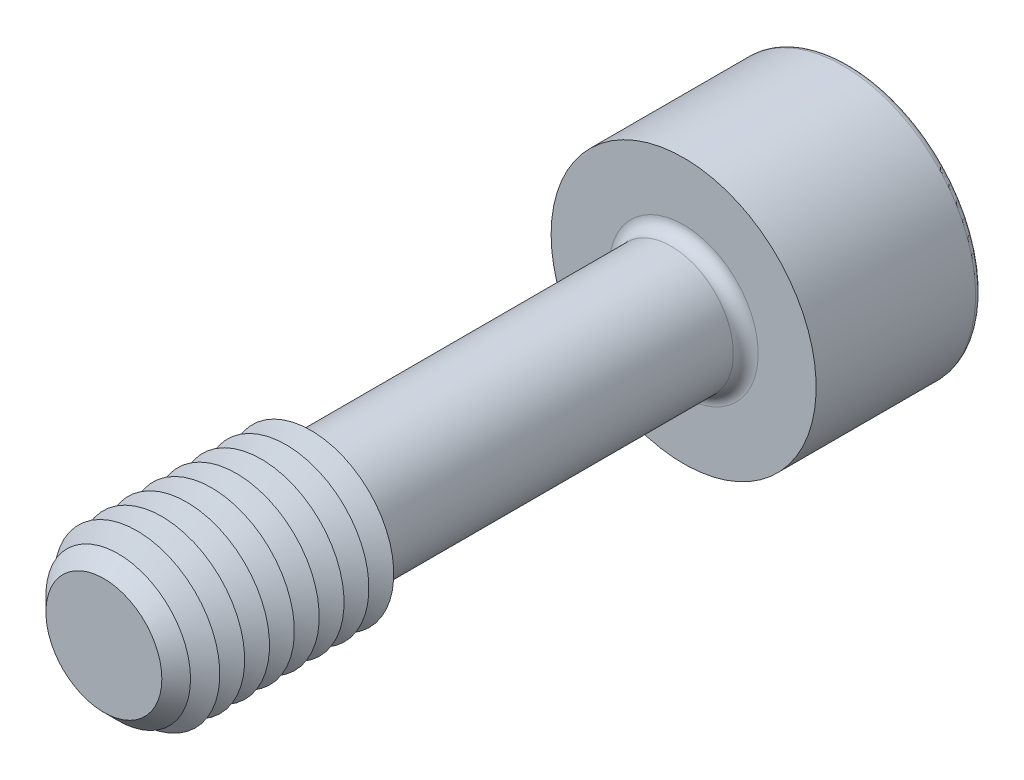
ISO-10303-21;
HEADER;
FILE_DESCRIPTION(('STEP AP214'),'2;1');
FILE_NAME('part.step','',(''),(''),'','','');
FILE_SCHEMA(('AUTOMOTIVE_DESIGN { 1 0 10303 214 1 1 1 1 }'));
ENDSEC;
DATA;
#1=APPLICATION_CONTEXT('core data for automotive mechanical design processes');
#2=APPLICATION_PROTOCOL_DEFINITION('international standard','automotive_design',2000,#1);
#3=PRODUCT_CONTEXT('',#1,'mechanical');
#4=PRODUCT('Part','Part','',(#3));
#5=PRODUCT_RELATED_PRODUCT_CATEGORY('part','',(#4));
#6=PRODUCT_DEFINITION_FORMATION('','',#4);
#7=PRODUCT_DEFINITION_CONTEXT('part definition',#1,'design');
#8=PRODUCT_DEFINITION('design','',#6,#7);
#9=PRODUCT_DEFINITION_SHAPE('','',#8);
#10=(LENGTH_UNIT() NAMED_UNIT(*) SI_UNIT(.MILLI.,.METRE.));
#11=(NAMED_UNIT(*) PLANE_ANGLE_UNIT() SI_UNIT($,.RADIAN.));
#12=(NAMED_UNIT(*) SI_UNIT($,.STERADIAN.) SOLID_ANGLE_UNIT());
#13=UNCERTAINTY_MEASURE_WITH_UNIT(LENGTH_MEASURE(1.E-05),#10,'distance_accuracy_value','');
#14=(GEOMETRIC_REPRESENTATION_CONTEXT(3) GLOBAL_UNCERTAINTY_ASSIGNED_CONTEXT((#13)) GLOBAL_UNIT_ASSIGNED_CONTEXT((#10,
#11,#12)) REPRESENTATION_CONTEXT('',''));
#15=CARTESIAN_POINT('',(0.,0.,0.));
#16=DIRECTION('',(0.,0.,1.));
#17=DIRECTION('',(1.,0.,0.));
#18=AXIS2_PLACEMENT_3D('',#15,#16,#17);
#19=CARTESIAN_POINT('',(-2.3094010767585,-4.,-19.5));
#20=DIRECTION('',(0.,0.,1.));
#21=DIRECTION('',(1.,0.,0.));
#22=AXIS2_PLACEMENT_3D('',#19,#20,#21);
#23=PLANE('',#22);
#24=DIRECTION('',(1.,0.,0.));
#25=VECTOR('',#24,1.);
#26=CARTESIAN_POINT('',(-2.3094010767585,-4.,-19.5));
#27=LINE('',#26,#25);
#28=CARTESIAN_POINT('',(0.,-4.,-19.5));
#29=VERTEX_POINT('',#28);
#30=CARTESIAN_POINT('',(2.3094010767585,-4.,-19.5));
#31=VERTEX_POINT('',#30);
#32=EDGE_CURVE('E761',#29,#31,#27,.T.);
#33=ORIENTED_EDGE('',*,*,#32,.F.);
#34=CARTESIAN_POINT('',(0.,0.,-19.5));
#35=DIRECTION('',(0.,0.,1.));
#36=DIRECTION('',(0.,-1.,0.));
#37=AXIS2_PLACEMENT_3D('',#34,#35,#36);
#38=CIRCLE('',#37,4.);
#39=CARTESIAN_POINT('',(3.46410161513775,-2.,-19.5));
#40=VERTEX_POINT('',#39);
#41=EDGE_CURVE('E53',#29,#40,#38,.T.);
#42=ORIENTED_EDGE('',*,*,#41,.T.);
#43=DIRECTION('',(0.5,0.866025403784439,0.));
#44=VECTOR('',#43,1.);
#45=CARTESIAN_POINT('',(2.3094010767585,-4.,-19.5));
#46=LINE('',#45,#44);
#47=EDGE_CURVE('E747',#31,#40,#46,.T.);
#48=ORIENTED_EDGE('',*,*,#47,.F.);
#49=EDGE_LOOP('',(#33,#42,#48));
#50=FACE_BOUND('',#49,.T.);
#51=ADVANCED_FACE('F41',(#50),#23,.F.);
#52=CARTESIAN_POINT('',(4.618802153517,0.,-19.5));
#53=VERTEX_POINT('',#52);
#54=EDGE_CURVE('E758',#40,#53,#46,.T.);
#55=ORIENTED_EDGE('',*,*,#54,.F.);
#56=CARTESIAN_POINT('',(3.46410161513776,2.,-19.5));
#57=VERTEX_POINT('',#56);
#58=EDGE_CURVE('E11',#40,#57,#38,.T.);
#59=ORIENTED_EDGE('',*,*,#58,.T.);
#60=DIRECTION('',(-0.5,0.866025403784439,0.));
#61=VECTOR('',#60,1.);
#62=CARTESIAN_POINT('',(4.618802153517,0.,-19.5));
#63=LINE('',#62,#61);
#64=EDGE_CURVE('E746',#53,#57,#63,.T.);
#65=ORIENTED_EDGE('',*,*,#64,.F.);
#66=EDGE_LOOP('',(#55,#59,#65));
#67=FACE_BOUND('',#66,.T.);
#68=ADVANCED_FACE('F133',(#67),#23,.F.);
#69=CARTESIAN_POINT('',(2.3094010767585,4.,-19.5));
#70=VERTEX_POINT('',#69);
#71=EDGE_CURVE('E742',#57,#70,#63,.T.);
#72=ORIENTED_EDGE('',*,*,#71,.F.);
#73=CARTESIAN_POINT('',(0.,4.,-19.5));
#74=VERTEX_POINT('',#73);
#75=EDGE_CURVE('E51',#57,#74,#38,.T.);
#76=ORIENTED_EDGE('',*,*,#75,.T.);
#77=DIRECTION('',(-1.,0.,0.));
#78=VECTOR('',#77,1.);
#79=CARTESIAN_POINT('',(2.3094010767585,4.,-19.5));
#80=LINE('',#79,#78);
#81=EDGE_CURVE('E177',#70,#74,#80,.T.);
#82=ORIENTED_EDGE('',*,*,#81,.F.);
#83=EDGE_LOOP('',(#72,#76,#82));
#84=FACE_BOUND('',#83,.T.);
#85=ADVANCED_FACE('F139',(#84),#23,.F.);
#86=CARTESIAN_POINT('',(-2.3094010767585,4.,-19.5));
#87=VERTEX_POINT('',#86);
#88=EDGE_CURVE('E752',#74,#87,#80,.T.);
#89=ORIENTED_EDGE('',*,*,#88,.F.);
#90=CARTESIAN_POINT('',(-3.46410161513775,2.,-19.5));
#91=VERTEX_POINT('',#90);
#92=EDGE_CURVE('E263',#74,#91,#38,.T.);
#93=ORIENTED_EDGE('',*,*,#92,.T.);
#94=DIRECTION('',(-0.500000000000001,-0.866025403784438,0.));
#95=VECTOR('',#94,1.);
#96=CARTESIAN_POINT('',(-2.3094010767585,4.,-19.5));
#97=LINE('',#96,#95);
#98=EDGE_CURVE('E176',#87,#91,#97,.T.);
#99=ORIENTED_EDGE('',*,*,#98,.F.);
#100=EDGE_LOOP('',(#89,#93,#99));
#101=FACE_BOUND('',#100,.T.);
#102=ADVANCED_FACE('F157',(#101),#23,.F.);
#103=CARTESIAN_POINT('',(-4.61880215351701,0.,-19.5));
#104=VERTEX_POINT('',#103);
#105=EDGE_CURVE('E170',#91,#104,#97,.T.);
#106=ORIENTED_EDGE('',*,*,#105,.F.);
#107=CARTESIAN_POINT('',(-3.46410161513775,-2.,-19.5));
#108=VERTEX_POINT('',#107);
#109=EDGE_CURVE('E172',#91,#108,#38,.T.);
#110=ORIENTED_EDGE('',*,*,#109,.T.);
#111=DIRECTION('',(0.5,-0.866025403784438,0.));
#112=VECTOR('',#111,1.);
#113=CARTESIAN_POINT('',(-4.61880215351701,0.,-19.5));
#114=LINE('',#113,#112);
#115=EDGE_CURVE('E174',#104,#108,#114,.T.);
#116=ORIENTED_EDGE('',*,*,#115,.F.);
#117=EDGE_LOOP('',(#106,#110,#116));
#118=FACE_BOUND('',#117,.T.);
#119=ADVANCED_FACE('F146',(#118),#23,.F.);
#120=CARTESIAN_POINT('',(0.,0.,-27.5));
#121=DIRECTION('',(0.,0.,-1.));
#122=DIRECTION('',(-1.,0.,0.));
#123=AXIS2_PLACEMENT_3D('',#120,#121,#122);
#124=PLANE('',#123);
#125=CARTESIAN_POINT('',(0.,0.,-27.5));
#126=DIRECTION('',(0.,0.,-1.));
#127=DIRECTION('',(-1.,0.,0.));
#128=AXIS2_PLACEMENT_3D('',#125,#126,#127);
#129=CIRCLE('',#128,7.625);
#130=CARTESIAN_POINT('',(-7.625,0.,-27.5));
#131=VERTEX_POINT('',#130);
#132=EDGE_CURVE('E250',#131,#131,#129,.T.);
#133=ORIENTED_EDGE('',*,*,#132,.T.);
#134=EDGE_LOOP('',(#133));
#135=FACE_BOUND('',#134,.T.);
#136=DIRECTION('',(-0.500000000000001,-0.866025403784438,0.));
#137=VECTOR('',#136,1.);
#138=CARTESIAN_POINT('',(-2.3094010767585,4.,-27.5));
#139=LINE('',#138,#137);
#140=CARTESIAN_POINT('',(-2.3094010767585,4.,-27.5));
#141=VERTEX_POINT('',#140);
#142=CARTESIAN_POINT('',(-4.61880215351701,0.,-27.5));
#143=VERTEX_POINT('',#142);
#144=EDGE_CURVE('E211',#141,#143,#139,.T.);
#145=ORIENTED_EDGE('',*,*,#144,.T.);
#146=DIRECTION('',(0.5,-0.866025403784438,0.));
#147=VECTOR('',#146,1.);
#148=CARTESIAN_POINT('',(-4.61880215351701,0.,-27.5));
#149=LINE('',#148,#147);
#150=CARTESIAN_POINT('',(-2.3094010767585,-4.,-27.5));
#151=VERTEX_POINT('',#150);
#152=EDGE_CURVE('E67',#143,#151,#149,.T.);
#153=ORIENTED_EDGE('',*,*,#152,.T.);
#154=DIRECTION('',(1.,0.,0.));
#155=VECTOR('',#154,1.);
#156=CARTESIAN_POINT('',(-2.3094010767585,-4.,-27.5));
#157=LINE('',#156,#155);
#158=CARTESIAN_POINT('',(2.3094010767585,-4.,-27.5));
#159=VERTEX_POINT('',#158);
#160=EDGE_CURVE('E195',#151,#159,#157,.T.);
#161=ORIENTED_EDGE('',*,*,#160,.T.);
#162=DIRECTION('',(0.5,0.866025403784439,0.));
#163=VECTOR('',#162,1.);
#164=CARTESIAN_POINT('',(2.3094010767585,-4.,-27.5));
#165=LINE('',#164,#163);
#166=CARTESIAN_POINT('',(4.618802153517,0.,-27.5));
#167=VERTEX_POINT('',#166);
#168=EDGE_CURVE('E199',#159,#167,#165,.T.);
#169=ORIENTED_EDGE('',*,*,#168,.T.);
#170=DIRECTION('',(-0.5,0.866025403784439,0.));
#171=VECTOR('',#170,1.);
#172=CARTESIAN_POINT('',(4.618802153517,0.,-27.5));
#173=LINE('',#172,#171);
#174=CARTESIAN_POINT('',(2.3094010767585,4.,-27.5));
#175=VERTEX_POINT('',#174);
#176=EDGE_CURVE('E203',#167,#175,#173,.T.);
#177=ORIENTED_EDGE('',*,*,#176,.T.);
#178=DIRECTION('',(-1.,0.,0.));
#179=VECTOR('',#178,1.);
#180=CARTESIAN_POINT('',(2.3094010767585,4.,-27.5));
#181=LINE('',#180,#179);
#182=EDGE_CURVE('E207',#175,#141,#181,.T.);
#183=ORIENTED_EDGE('',*,*,#182,.T.);
#184=EDGE_LOOP('',(#145,#153,#161,#169,#177,#183));
#185=FACE_BOUND('',#184,.T.);
#186=ADVANCED_FACE('F156',(#135,#185),#124,.T.);
#187=CARTESIAN_POINT('',(0.,0.,17.5));
#188=DIRECTION('',(0.,0.,-1.));
#189=DIRECTION('',(-1.,0.,0.));
#190=AXIS2_PLACEMENT_3D('',#187,#188,#189);
#191=CYLINDRICAL_SURFACE('',#190,3.75);
#192=CARTESIAN_POINT('',(0.,0.,-16.75));
#193=DIRECTION('',(0.,0.,-1.));
#194=DIRECTION('',(-1.,0.,0.));
#195=AXIS2_PLACEMENT_3D('',#192,#193,#194);
#196=CIRCLE('',#195,3.75);
#197=CARTESIAN_POINT('',(-3.75,0.,-16.75));
#198=VERTEX_POINT('',#197);
#199=EDGE_CURVE('E246',#198,#198,#196,.F.);
#200=ORIENTED_EDGE('',*,*,#199,.T.);
#201=EDGE_LOOP('',(#200));
#202=FACE_BOUND('',#201,.T.);
#203=CARTESIAN_POINT('',(0.,0.,4.27831216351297));
#204=DIRECTION('',(0.,0.,-1.));
#205=DIRECTION('',(0.,1.,0.));
#206=AXIS2_PLACEMENT_3D('',#203,#204,#205);
#207=CIRCLE('',#206,3.75);
#208=CARTESIAN_POINT('',(0.,3.75,4.27831216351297));
#209=VERTEX_POINT('',#208);
#210=EDGE_CURVE('E234',#209,#209,#207,.T.);
#211=ORIENTED_EDGE('',*,*,#210,.T.);
#212=EDGE_LOOP('',(#211));
#213=FACE_BOUND('',#212,.T.);
#214=ADVANCED_FACE('F163',(#202,#213),#191,.T.);
#215=CARTESIAN_POINT('',(0.,0.,4.27831216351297));
#216=DIRECTION('',(0.,0.,1.));
#217=DIRECTION('',(0.,-1.,0.));
#218=AXIS2_PLACEMENT_3D('',#215,#216,#217);
#219=CONICAL_SURFACE('',#218,3.75,1.0471975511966);
#220=CARTESIAN_POINT('',(0.,0.,5.));
#221=DIRECTION('',(0.,0.,-1.));
#222=DIRECTION('',(-1.,0.,0.));
#223=AXIS2_PLACEMENT_3D('',#220,#221,#222);
#224=CIRCLE('',#223,5.);
#225=CARTESIAN_POINT('',(-5.,0.,5.));
#226=VERTEX_POINT('',#225);
#227=EDGE_CURVE('E267',#226,#226,#224,.T.);
#228=ORIENTED_EDGE('',*,*,#227,.T.);
#229=EDGE_LOOP('',(#228));
#230=FACE_BOUND('',#229,.T.);
#231=ORIENTED_EDGE('',*,*,#210,.F.);
#232=EDGE_LOOP('',(#231));
#233=FACE_BOUND('',#232,.T.);
#234=ADVANCED_FACE('F511',(#230,#233),#219,.T.);
#235=CARTESIAN_POINT('',(0.,0.,-17.5));
#236=DIRECTION('',(0.,0.,-1.));
#237=DIRECTION('',(-1.,0.,0.));
#238=AXIS2_PLACEMENT_3D('',#235,#236,#237);
#239=PLANE('',#238);
#240=CARTESIAN_POINT('',(0.,0.,-17.5));
#241=DIRECTION('',(0.,0.,-1.));
#242=DIRECTION('',(-1.,0.,0.));
#243=AXIS2_PLACEMENT_3D('',#240,#241,#242);
#244=CIRCLE('',#243,4.5);
#245=CARTESIAN_POINT('',(-4.5,0.,-17.5));
#246=VERTEX_POINT('',#245);
#247=EDGE_CURVE('E242',#246,#246,#244,.T.);
#248=ORIENTED_EDGE('',*,*,#247,.T.);
#249=EDGE_LOOP('',(#248));
#250=FACE_BOUND('',#249,.T.);
#251=CARTESIAN_POINT('',(0.,0.,-17.5));
#252=DIRECTION('',(0.,0.,-1.));
#253=DIRECTION('',(-1.,0.,0.));
#254=AXIS2_PLACEMENT_3D('',#251,#252,#253);
#255=CIRCLE('',#254,8.);
#256=CARTESIAN_POINT('',(-8.,0.,-17.5));
#257=VERTEX_POINT('',#256);
#258=EDGE_CURVE('E230',#257,#257,#255,.T.);
#259=ORIENTED_EDGE('',*,*,#258,.F.);
#260=EDGE_LOOP('',(#259));
#261=FACE_BOUND('',#260,.T.);
#262=ADVANCED_FACE('F504',(#250,#261),#239,.F.);
#263=CARTESIAN_POINT('',(0.,0.,-27.5));
#264=DIRECTION('',(0.,0.,1.));
#265=DIRECTION('',(1.,0.,0.));
#266=AXIS2_PLACEMENT_3D('',#263,#264,#265);
#267=CYLINDRICAL_SURFACE('',#266,8.);
#268=CARTESIAN_POINT('',(0.,0.,-27.125));
#269=DIRECTION('',(0.,0.,-1.));
#270=DIRECTION('',(-1.,0.,0.));
#271=AXIS2_PLACEMENT_3D('',#268,#269,#270);
#272=CIRCLE('',#271,8.);
#273=CARTESIAN_POINT('',(-8.,0.,-27.125));
#274=VERTEX_POINT('',#273);
#275=EDGE_CURVE('E253',#274,#274,#272,.F.);
#276=ORIENTED_EDGE('',*,*,#275,.T.);
#277=EDGE_LOOP('',(#276));
#278=FACE_BOUND('',#277,.T.);
#279=ORIENTED_EDGE('',*,*,#258,.T.);
#280=EDGE_LOOP('',(#279));
#281=FACE_BOUND('',#280,.T.);
#282=ADVANCED_FACE('F510',(#278,#281),#267,.T.);
#283=CARTESIAN_POINT('',(-4.61880215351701,0.,-19.5));
#284=DIRECTION('',(0.866025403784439,0.5,0.));
#285=DIRECTION('',(-0.5,0.866025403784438,0.));
#286=AXIS2_PLACEMENT_3D('',#283,#284,#285);
#287=PLANE('',#286);
#288=ORIENTED_EDGE('',*,*,#152,.F.);
#289=DIRECTION('',(0.,0.,-1.));
#290=VECTOR('',#289,1.);
#291=CARTESIAN_POINT('',(-4.61880215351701,0.,-19.5));
#292=LINE('',#291,#290);
#293=EDGE_CURVE('E186',#104,#143,#292,.T.);
#294=ORIENTED_EDGE('',*,*,#293,.F.);
#295=ORIENTED_EDGE('',*,*,#115,.T.);
#296=CARTESIAN_POINT('',(-2.3094010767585,-4.,-19.5));
#297=VERTEX_POINT('',#296);
#298=EDGE_CURVE('E214',#108,#297,#114,.T.);
#299=ORIENTED_EDGE('',*,*,#298,.T.);
#300=DIRECTION('',(0.,0.,-1.));
#301=VECTOR('',#300,1.);
#302=CARTESIAN_POINT('',(-2.3094010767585,-4.,-19.5));
#303=LINE('',#302,#301);
#304=EDGE_CURVE('E227',#297,#151,#303,.T.);
#305=ORIENTED_EDGE('',*,*,#304,.T.);
#306=EDGE_LOOP('',(#288,#294,#295,#299,#305));
#307=FACE_BOUND('',#306,.T.);
#308=ADVANCED_FACE('F522',(#307),#287,.T.);
#309=CARTESIAN_POINT('',(-2.3094010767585,-4.,-19.5));
#310=DIRECTION('',(0.,1.,0.));
#311=DIRECTION('',(-1.,0.,0.));
#312=AXIS2_PLACEMENT_3D('',#309,#310,#311);
#313=PLANE('',#312);
#314=ORIENTED_EDGE('',*,*,#160,.F.);
#315=ORIENTED_EDGE('',*,*,#304,.F.);
#316=EDGE_CURVE('E759',#297,#29,#27,.T.);
#317=ORIENTED_EDGE('',*,*,#316,.T.);
#318=ORIENTED_EDGE('',*,*,#32,.T.);
#319=DIRECTION('',(0.,0.,-1.));
#320=VECTOR('',#319,1.);
#321=CARTESIAN_POINT('',(2.3094010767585,-4.,-19.5));
#322=LINE('',#321,#320);
#323=EDGE_CURVE('E224',#31,#159,#322,.T.);
#324=ORIENTED_EDGE('',*,*,#323,.T.);
#325=EDGE_LOOP('',(#314,#315,#317,#318,#324));
#326=FACE_BOUND('',#325,.T.);
#327=ADVANCED_FACE('F538',(#326),#313,.T.);
#328=CARTESIAN_POINT('',(2.3094010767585,-4.,-19.5));
#329=DIRECTION('',(-0.866025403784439,0.5,0.));
#330=DIRECTION('',(-0.5,-0.866025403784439,0.));
#331=AXIS2_PLACEMENT_3D('',#328,#329,#330);
#332=PLANE('',#331);
#333=ORIENTED_EDGE('',*,*,#168,.F.);
#334=ORIENTED_EDGE('',*,*,#323,.F.);
#335=ORIENTED_EDGE('',*,*,#47,.T.);
#336=ORIENTED_EDGE('',*,*,#54,.T.);
#337=DIRECTION('',(0.,0.,-1.));
#338=VECTOR('',#337,1.);
#339=CARTESIAN_POINT('',(4.618802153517,0.,-19.5));
#340=LINE('',#339,#338);
#341=EDGE_CURVE('E221',#53,#167,#340,.T.);
#342=ORIENTED_EDGE('',*,*,#341,.T.);
#343=EDGE_LOOP('',(#333,#334,#335,#336,#342));
#344=FACE_BOUND('',#343,.T.);
#345=ADVANCED_FACE('F548',(#344),#332,.T.);
#346=CARTESIAN_POINT('',(4.618802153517,0.,-19.5));
#347=DIRECTION('',(-0.866025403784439,-0.5,0.));
#348=DIRECTION('',(0.5,-0.866025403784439,0.));
#349=AXIS2_PLACEMENT_3D('',#346,#347,#348);
#350=PLANE('',#349);
#351=ORIENTED_EDGE('',*,*,#176,.F.);
#352=ORIENTED_EDGE('',*,*,#341,.F.);
#353=ORIENTED_EDGE('',*,*,#64,.T.);
#354=ORIENTED_EDGE('',*,*,#71,.T.);
#355=DIRECTION('',(0.,0.,-1.));
#356=VECTOR('',#355,1.);
#357=CARTESIAN_POINT('',(2.3094010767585,4.,-19.5));
#358=LINE('',#357,#356);
#359=EDGE_CURVE('E218',#70,#175,#358,.T.);
#360=ORIENTED_EDGE('',*,*,#359,.T.);
#361=EDGE_LOOP('',(#351,#352,#353,#354,#360));
#362=FACE_BOUND('',#361,.T.);
#363=ADVANCED_FACE('F558',(#362),#350,.T.);
#364=CARTESIAN_POINT('',(2.3094010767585,4.,-19.5));
#365=DIRECTION('',(0.,-1.,0.));
#366=DIRECTION('',(0.,0.,-1.));
#367=AXIS2_PLACEMENT_3D('',#364,#365,#366);
#368=PLANE('',#367);
#369=ORIENTED_EDGE('',*,*,#182,.F.);
#370=ORIENTED_EDGE('',*,*,#359,.F.);
#371=ORIENTED_EDGE('',*,*,#81,.T.);
#372=ORIENTED_EDGE('',*,*,#88,.T.);
#373=DIRECTION('',(0.,0.,-1.));
#374=VECTOR('',#373,1.);
#375=CARTESIAN_POINT('',(-2.3094010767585,4.,-19.5));
#376=LINE('',#375,#374);
#377=EDGE_CURVE('E182',#87,#141,#376,.T.);
#378=ORIENTED_EDGE('',*,*,#377,.T.);
#379=EDGE_LOOP('',(#369,#370,#371,#372,#378));
#380=FACE_BOUND('',#379,.T.);
#381=ADVANCED_FACE('F152',(#380),#368,.T.);
#382=CARTESIAN_POINT('',(-2.3094010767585,4.,-19.5));
#383=DIRECTION('',(0.866025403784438,-0.500000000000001,0.));
#384=DIRECTION('',(0.500000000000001,0.866025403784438,0.));
#385=AXIS2_PLACEMENT_3D('',#382,#383,#384);
#386=PLANE('',#385);
#387=ORIENTED_EDGE('',*,*,#144,.F.);
#388=ORIENTED_EDGE('',*,*,#377,.F.);
#389=ORIENTED_EDGE('',*,*,#98,.T.);
#390=ORIENTED_EDGE('',*,*,#105,.T.);
#391=ORIENTED_EDGE('',*,*,#293,.T.);
#392=EDGE_LOOP('',(#387,#388,#389,#390,#391));
#393=FACE_BOUND('',#392,.T.);
#394=ADVANCED_FACE('F144',(#393),#386,.T.);
#395=ORIENTED_EDGE('',*,*,#298,.F.);
#396=EDGE_CURVE('E256',#108,#29,#38,.T.);
#397=ORIENTED_EDGE('',*,*,#396,.T.);
#398=ORIENTED_EDGE('',*,*,#316,.F.);
#399=EDGE_LOOP('',(#395,#397,#398));
#400=FACE_BOUND('',#399,.T.);
#401=ADVANCED_FACE('F135',(#400),#23,.F.);
#402=CARTESIAN_POINT('',(0.,0.,-16.75));
#403=DIRECTION('',(0.,0.,-1.));
#404=DIRECTION('',(-1.,0.,0.));
#405=AXIS2_PLACEMENT_3D('',#402,#403,#404);
#406=TOROIDAL_SURFACE('',#405,4.5,0.75);
#407=ORIENTED_EDGE('',*,*,#199,.F.);
#408=EDGE_LOOP('',(#407));
#409=FACE_BOUND('',#408,.T.);
#410=ORIENTED_EDGE('',*,*,#247,.F.);
#411=EDGE_LOOP('',(#410));
#412=FACE_BOUND('',#411,.T.);
#413=ADVANCED_FACE('F129',(#409,#412),#406,.F.);
#414=CARTESIAN_POINT('',(0.,0.,-27.125));
#415=DIRECTION('',(0.,0.,-1.));
#416=DIRECTION('',(-1.,0.,0.));
#417=AXIS2_PLACEMENT_3D('',#414,#415,#416);
#418=TOROIDAL_SURFACE('',#417,7.625,0.375);
#419=ORIENTED_EDGE('',*,*,#275,.F.);
#420=EDGE_LOOP('',(#419));
#421=FACE_BOUND('',#420,.T.);
#422=ORIENTED_EDGE('',*,*,#132,.F.);
#423=EDGE_LOOP('',(#422));
#424=FACE_BOUND('',#423,.T.);
#425=ADVANCED_FACE('F43',(#421,#424),#418,.T.);
#426=CARTESIAN_POINT('',(0.,0.,-17.1905989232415));
#427=DIRECTION('',(0.,0.,-1.));
#428=DIRECTION('',(0.,1.,0.));
#429=AXIS2_PLACEMENT_3D('',#426,#427,#428);
#430=CONICAL_SURFACE('',#429,0.,1.0471975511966);
#431=ORIENTED_EDGE('',*,*,#41,.F.);
#432=ORIENTED_EDGE('',*,*,#396,.F.);
#433=ORIENTED_EDGE('',*,*,#109,.F.);
#434=ORIENTED_EDGE('',*,*,#92,.F.);
#435=ORIENTED_EDGE('',*,*,#75,.F.);
#436=ORIENTED_EDGE('',*,*,#58,.F.);
#437=EDGE_LOOP('',(#431,#432,#433,#434,#435,#436));
#438=FACE_BOUND('',#437,.T.);
#439=CARTESIAN_POINT('',(0.,0.,-17.1905989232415));
#440=VERTEX_POINT('',#439);
#441=VERTEX_LOOP('',#440);
#442=FACE_BOUND('',#441,.T.);
#443=ADVANCED_FACE('F118',(#438,#442),#430,.F.);
#444=CARTESIAN_POINT('',(0.,0.,5.75));
#445=DIRECTION('',(0.,0.,-1.));
#446=DIRECTION('',(-1.,0.,0.));
#447=AXIS2_PLACEMENT_3D('',#444,#445,#446);
#448=CONICAL_SURFACE('',#447,3.70096189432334,1.0471975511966);
#449=ORIENTED_EDGE('',*,*,#227,.F.);
#450=EDGE_LOOP('',(#449));
#451=FACE_BOUND('',#450,.T.);
#452=CARTESIAN_POINT('',(0.,0.,5.75));
#453=DIRECTION('',(0.,0.,-1.));
#454=DIRECTION('',(-1.,0.,0.));
#455=AXIS2_PLACEMENT_3D('',#452,#453,#454);
#456=CIRCLE('',#455,3.70096189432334);
#457=CARTESIAN_POINT('',(-3.70096189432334,0.,5.75));
#458=VERTEX_POINT('',#457);
#459=EDGE_CURVE('E273',#458,#458,#456,.T.);
#460=ORIENTED_EDGE('',*,*,#459,.T.);
#461=EDGE_LOOP('',(#460));
#462=FACE_BOUND('',#461,.T.);
#463=ADVANCED_FACE('F120',(#451,#462),#448,.T.);
#464=CARTESIAN_POINT('',(0.,0.,6.5));
#465=DIRECTION('',(0.,0.,1.));
#466=DIRECTION('',(1.,0.,0.));
#467=AXIS2_PLACEMENT_3D('',#464,#465,#466);
#468=CONICAL_SURFACE('',#467,5.,1.0471975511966);
#469=ORIENTED_EDGE('',*,*,#459,.F.);
#470=EDGE_LOOP('',(#469));
#471=FACE_BOUND('',#470,.T.);
#472=CARTESIAN_POINT('',(0.,0.,6.5));
#473=DIRECTION('',(0.,0.,-1.));
#474=DIRECTION('',(-1.,0.,0.));
#475=AXIS2_PLACEMENT_3D('',#472,#473,#474);
#476=CIRCLE('',#475,5.);
#477=CARTESIAN_POINT('',(-5.,0.,6.5));
#478=VERTEX_POINT('',#477);
#479=EDGE_CURVE('E279',#478,#478,#476,.T.);
#480=ORIENTED_EDGE('',*,*,#479,.T.);
#481=EDGE_LOOP('',(#480));
#482=FACE_BOUND('',#481,.T.);
#483=ADVANCED_FACE('F126',(#471,#482),#468,.T.);
#484=CARTESIAN_POINT('',(0.,0.,7.25));
#485=DIRECTION('',(0.,0.,-1.));
#486=DIRECTION('',(-1.,0.,0.));
#487=AXIS2_PLACEMENT_3D('',#484,#485,#486);
#488=CONICAL_SURFACE('',#487,3.70096189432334,1.0471975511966);
#489=ORIENTED_EDGE('',*,*,#479,.F.);
#490=EDGE_LOOP('',(#489));
#491=FACE_BOUND('',#490,.T.);
#492=CARTESIAN_POINT('',(0.,0.,7.25));
#493=DIRECTION('',(0.,0.,-1.));
#494=DIRECTION('',(-1.,0.,0.));
#495=AXIS2_PLACEMENT_3D('',#492,#493,#494);
#496=CIRCLE('',#495,3.70096189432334);
#497=CARTESIAN_POINT('',(-3.70096189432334,0.,7.25));
#498=VERTEX_POINT('',#497);
#499=EDGE_CURVE('E285',#498,#498,#496,.T.);
#500=ORIENTED_EDGE('',*,*,#499,.T.);
#501=EDGE_LOOP('',(#500));
#502=FACE_BOUND('',#501,.T.);
#503=ADVANCED_FACE('F398',(#491,#502),#488,.T.);
#504=CARTESIAN_POINT('',(0.,0.,8.));
#505=DIRECTION('',(0.,0.,1.));
#506=DIRECTION('',(1.,0.,0.));
#507=AXIS2_PLACEMENT_3D('',#504,#505,#506);
#508=CONICAL_SURFACE('',#507,5.,1.0471975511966);
#509=ORIENTED_EDGE('',*,*,#499,.F.);
#510=EDGE_LOOP('',(#509));
#511=FACE_BOUND('',#510,.T.);
#512=CARTESIAN_POINT('',(0.,0.,8.));
#513=DIRECTION('',(0.,0.,-1.));
#514=DIRECTION('',(-1.,0.,0.));
#515=AXIS2_PLACEMENT_3D('',#512,#513,#514);
#516=CIRCLE('',#515,5.);
#517=CARTESIAN_POINT('',(-5.,0.,8.));
#518=VERTEX_POINT('',#517);
#519=EDGE_CURVE('E289',#518,#518,#516,.T.);
#520=ORIENTED_EDGE('',*,*,#519,.T.);
#521=EDGE_LOOP('',(#520));
#522=FACE_BOUND('',#521,.T.);
#523=ADVANCED_FACE('F394',(#511,#522),#508,.T.);
#524=CARTESIAN_POINT('',(0.,0.,8.75));
#525=DIRECTION('',(0.,0.,-1.));
#526=DIRECTION('',(-1.,0.,0.));
#527=AXIS2_PLACEMENT_3D('',#524,#525,#526);
#528=CONICAL_SURFACE('',#527,3.70096189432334,1.0471975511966);
#529=ORIENTED_EDGE('',*,*,#519,.F.);
#530=EDGE_LOOP('',(#529));
#531=FACE_BOUND('',#530,.T.);
#532=CARTESIAN_POINT('',(0.,0.,8.75));
#533=DIRECTION('',(0.,0.,-1.));
#534=DIRECTION('',(-1.,0.,0.));
#535=AXIS2_PLACEMENT_3D('',#532,#533,#534);
#536=CIRCLE('',#535,3.70096189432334);
#537=CARTESIAN_POINT('',(-3.70096189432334,0.,8.75));
#538=VERTEX_POINT('',#537);
#539=EDGE_CURVE('E293',#538,#538,#536,.T.);
#540=ORIENTED_EDGE('',*,*,#539,.T.);
#541=EDGE_LOOP('',(#540));
#542=FACE_BOUND('',#541,.T.);
#543=ADVANCED_FACE('F390',(#531,#542),#528,.T.);
#544=CARTESIAN_POINT('',(0.,0.,9.5));
#545=DIRECTION('',(0.,0.,1.));
#546=DIRECTION('',(1.,0.,0.));
#547=AXIS2_PLACEMENT_3D('',#544,#545,#546);
#548=CONICAL_SURFACE('',#547,5.,1.0471975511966);
#549=ORIENTED_EDGE('',*,*,#539,.F.);
#550=EDGE_LOOP('',(#549));
#551=FACE_BOUND('',#550,.T.);
#552=CARTESIAN_POINT('',(0.,0.,9.5));
#553=DIRECTION('',(0.,0.,-1.));
#554=DIRECTION('',(-1.,0.,0.));
#555=AXIS2_PLACEMENT_3D('',#552,#553,#554);
#556=CIRCLE('',#555,5.);
#557=CARTESIAN_POINT('',(-5.,0.,9.5));
#558=VERTEX_POINT('',#557);
#559=EDGE_CURVE('E297',#558,#558,#556,.T.);
#560=ORIENTED_EDGE('',*,*,#559,.T.);
#561=EDGE_LOOP('',(#560));
#562=FACE_BOUND('',#561,.T.);
#563=ADVANCED_FACE('F386',(#551,#562),#548,.T.);
#564=CARTESIAN_POINT('',(0.,0.,10.25));
#565=DIRECTION('',(0.,0.,-1.));
#566=DIRECTION('',(-1.,0.,0.));
#567=AXIS2_PLACEMENT_3D('',#564,#565,#566);
#568=CONICAL_SURFACE('',#567,3.70096189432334,1.0471975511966);
#569=ORIENTED_EDGE('',*,*,#559,.F.);
#570=EDGE_LOOP('',(#569));
#571=FACE_BOUND('',#570,.T.);
#572=CARTESIAN_POINT('',(0.,0.,10.25));
#573=DIRECTION('',(0.,0.,-1.));
#574=DIRECTION('',(-1.,0.,0.));
#575=AXIS2_PLACEMENT_3D('',#572,#573,#574);
#576=CIRCLE('',#575,3.70096189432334);
#577=CARTESIAN_POINT('',(-3.70096189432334,0.,10.25));
#578=VERTEX_POINT('',#577);
#579=EDGE_CURVE('E301',#578,#578,#576,.T.);
#580=ORIENTED_EDGE('',*,*,#579,.T.);
#581=EDGE_LOOP('',(#580));
#582=FACE_BOUND('',#581,.T.);
#583=ADVANCED_FACE('F382',(#571,#582),#568,.T.);
#584=CARTESIAN_POINT('',(0.,0.,11.));
#585=DIRECTION('',(0.,0.,1.));
#586=DIRECTION('',(1.,0.,0.));
#587=AXIS2_PLACEMENT_3D('',#584,#585,#586);
#588=CONICAL_SURFACE('',#587,5.,1.0471975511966);
#589=ORIENTED_EDGE('',*,*,#579,.F.);
#590=EDGE_LOOP('',(#589));
#591=FACE_BOUND('',#590,.T.);
#592=CARTESIAN_POINT('',(0.,0.,11.));
#593=DIRECTION('',(0.,0.,-1.));
#594=DIRECTION('',(-1.,0.,0.));
#595=AXIS2_PLACEMENT_3D('',#592,#593,#594);
#596=CIRCLE('',#595,5.);
#597=CARTESIAN_POINT('',(-5.,0.,11.));
#598=VERTEX_POINT('',#597);
#599=EDGE_CURVE('E305',#598,#598,#596,.T.);
#600=ORIENTED_EDGE('',*,*,#599,.T.);
#601=EDGE_LOOP('',(#600));
#602=FACE_BOUND('',#601,.T.);
#603=ADVANCED_FACE('F378',(#591,#602),#588,.T.);
#604=CARTESIAN_POINT('',(0.,0.,11.75));
#605=DIRECTION('',(0.,0.,-1.));
#606=DIRECTION('',(-1.,0.,0.));
#607=AXIS2_PLACEMENT_3D('',#604,#605,#606);
#608=CONICAL_SURFACE('',#607,3.70096189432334,1.0471975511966);
#609=ORIENTED_EDGE('',*,*,#599,.F.);
#610=EDGE_LOOP('',(#609));
#611=FACE_BOUND('',#610,.T.);
#612=CARTESIAN_POINT('',(0.,0.,11.75));
#613=DIRECTION('',(0.,0.,-1.));
#614=DIRECTION('',(-1.,0.,0.));
#615=AXIS2_PLACEMENT_3D('',#612,#613,#614);
#616=CIRCLE('',#615,3.70096189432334);
#617=CARTESIAN_POINT('',(-3.70096189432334,0.,11.75));
#618=VERTEX_POINT('',#617);
#619=EDGE_CURVE('E309',#618,#618,#616,.T.);
#620=ORIENTED_EDGE('',*,*,#619,.T.);
#621=EDGE_LOOP('',(#620));
#622=FACE_BOUND('',#621,.T.);
#623=ADVANCED_FACE('F374',(#611,#622),#608,.T.);
#624=CARTESIAN_POINT('',(0.,0.,12.5));
#625=DIRECTION('',(0.,0.,1.));
#626=DIRECTION('',(1.,0.,0.));
#627=AXIS2_PLACEMENT_3D('',#624,#625,#626);
#628=CONICAL_SURFACE('',#627,5.,1.0471975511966);
#629=ORIENTED_EDGE('',*,*,#619,.F.);
#630=EDGE_LOOP('',(#629));
#631=FACE_BOUND('',#630,.T.);
#632=CARTESIAN_POINT('',(0.,0.,12.5));
#633=DIRECTION('',(0.,0.,-1.));
#634=DIRECTION('',(-1.,0.,0.));
#635=AXIS2_PLACEMENT_3D('',#632,#633,#634);
#636=CIRCLE('',#635,5.);
#637=CARTESIAN_POINT('',(-5.,0.,12.5));
#638=VERTEX_POINT('',#637);
#639=EDGE_CURVE('E313',#638,#638,#636,.T.);
#640=ORIENTED_EDGE('',*,*,#639,.T.);
#641=EDGE_LOOP('',(#640));
#642=FACE_BOUND('',#641,.T.);
#643=ADVANCED_FACE('F370',(#631,#642),#628,.T.);
#644=CARTESIAN_POINT('',(0.,0.,13.25));
#645=DIRECTION('',(0.,0.,-1.));
#646=DIRECTION('',(-1.,0.,0.));
#647=AXIS2_PLACEMENT_3D('',#644,#645,#646);
#648=CONICAL_SURFACE('',#647,3.70096189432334,1.0471975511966);
#649=ORIENTED_EDGE('',*,*,#639,.F.);
#650=EDGE_LOOP('',(#649));
#651=FACE_BOUND('',#650,.T.);
#652=CARTESIAN_POINT('',(0.,0.,13.25));
#653=DIRECTION('',(0.,0.,-1.));
#654=DIRECTION('',(-1.,0.,0.));
#655=AXIS2_PLACEMENT_3D('',#652,#653,#654);
#656=CIRCLE('',#655,3.70096189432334);
#657=CARTESIAN_POINT('',(-3.70096189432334,0.,13.25));
#658=VERTEX_POINT('',#657);
#659=EDGE_CURVE('E317',#658,#658,#656,.T.);
#660=ORIENTED_EDGE('',*,*,#659,.T.);
#661=EDGE_LOOP('',(#660));
#662=FACE_BOUND('',#661,.T.);
#663=ADVANCED_FACE('F366',(#651,#662),#648,.T.);
#664=CARTESIAN_POINT('',(0.,0.,14.));
#665=DIRECTION('',(0.,0.,1.));
#666=DIRECTION('',(1.,0.,0.));
#667=AXIS2_PLACEMENT_3D('',#664,#665,#666);
#668=CONICAL_SURFACE('',#667,5.,1.0471975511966);
#669=ORIENTED_EDGE('',*,*,#659,.F.);
#670=EDGE_LOOP('',(#669));
#671=FACE_BOUND('',#670,.T.);
#672=CARTESIAN_POINT('',(0.,0.,14.));
#673=DIRECTION('',(0.,0.,-1.));
#674=DIRECTION('',(-1.,0.,0.));
#675=AXIS2_PLACEMENT_3D('',#672,#673,#674);
#676=CIRCLE('',#675,5.);
#677=CARTESIAN_POINT('',(-5.,0.,14.));
#678=VERTEX_POINT('',#677);
#679=EDGE_CURVE('E321',#678,#678,#676,.T.);
#680=ORIENTED_EDGE('',*,*,#679,.T.);
#681=EDGE_LOOP('',(#680));
#682=FACE_BOUND('',#681,.T.);
#683=ADVANCED_FACE('F362',(#671,#682),#668,.T.);
#684=CARTESIAN_POINT('',(0.,0.,14.75));
#685=DIRECTION('',(0.,0.,-1.));
#686=DIRECTION('',(-1.,0.,0.));
#687=AXIS2_PLACEMENT_3D('',#684,#685,#686);
#688=CONICAL_SURFACE('',#687,3.70096189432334,1.0471975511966);
#689=ORIENTED_EDGE('',*,*,#679,.F.);
#690=EDGE_LOOP('',(#689));
#691=FACE_BOUND('',#690,.T.);
#692=CARTESIAN_POINT('',(0.,0.,14.75));
#693=DIRECTION('',(0.,0.,-1.));
#694=DIRECTION('',(-1.,0.,0.));
#695=AXIS2_PLACEMENT_3D('',#692,#693,#694);
#696=CIRCLE('',#695,3.70096189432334);
#697=CARTESIAN_POINT('',(-3.70096189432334,0.,14.75));
#698=VERTEX_POINT('',#697);
#699=EDGE_CURVE('E325',#698,#698,#696,.T.);
#700=ORIENTED_EDGE('',*,*,#699,.T.);
#701=EDGE_LOOP('',(#700));
#702=FACE_BOUND('',#701,.T.);
#703=ADVANCED_FACE('F358',(#691,#702),#688,.T.);
#704=CARTESIAN_POINT('',(0.,0.,15.5));
#705=DIRECTION('',(0.,0.,1.));
#706=DIRECTION('',(1.,0.,0.));
#707=AXIS2_PLACEMENT_3D('',#704,#705,#706);
#708=CONICAL_SURFACE('',#707,5.,1.0471975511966);
#709=ORIENTED_EDGE('',*,*,#699,.F.);
#710=EDGE_LOOP('',(#709));
#711=FACE_BOUND('',#710,.T.);
#712=CARTESIAN_POINT('',(0.,0.,15.5));
#713=DIRECTION('',(0.,0.,-1.));
#714=DIRECTION('',(-1.,0.,0.));
#715=AXIS2_PLACEMENT_3D('',#712,#713,#714);
#716=CIRCLE('',#715,5.);
#717=CARTESIAN_POINT('',(-5.,0.,15.5));
#718=VERTEX_POINT('',#717);
#719=EDGE_CURVE('E328',#718,#718,#716,.T.);
#720=ORIENTED_EDGE('',*,*,#719,.T.);
#721=EDGE_LOOP('',(#720));
#722=FACE_BOUND('',#721,.T.);
#723=ADVANCED_FACE('F351',(#711,#722),#708,.T.);
#724=CARTESIAN_POINT('',(0.,0.,16.25));
#725=DIRECTION('',(0.,0.,-1.));
#726=DIRECTION('',(-1.,0.,0.));
#727=AXIS2_PLACEMENT_3D('',#724,#725,#726);
#728=CONICAL_SURFACE('',#727,3.70096189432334,1.0471975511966);
#729=ORIENTED_EDGE('',*,*,#719,.F.);
#730=EDGE_LOOP('',(#729));
#731=FACE_BOUND('',#730,.T.);
#732=CARTESIAN_POINT('',(0.,0.,16.25));
#733=DIRECTION('',(0.,0.,-1.));
#734=DIRECTION('',(-1.,0.,0.));
#735=AXIS2_PLACEMENT_3D('',#732,#733,#734);
#736=CIRCLE('',#735,3.70096189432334);
#737=CARTESIAN_POINT('',(-3.70096189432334,0.,16.25));
#738=VERTEX_POINT('',#737);
#739=EDGE_CURVE('E332',#738,#738,#736,.T.);
#740=ORIENTED_EDGE('',*,*,#739,.T.);
#741=EDGE_LOOP('',(#740));
#742=FACE_BOUND('',#741,.T.);
#743=ADVANCED_FACE('F337',(#731,#742),#728,.T.);
#744=CARTESIAN_POINT('',(0.,0.,17.));
#745=DIRECTION('',(0.,0.,1.));
#746=DIRECTION('',(1.,0.,0.));
#747=AXIS2_PLACEMENT_3D('',#744,#745,#746);
#748=CONICAL_SURFACE('',#747,5.,1.0471975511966);
#749=CARTESIAN_POINT('',(0.,0.,16.6339745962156));
#750=DIRECTION('',(0.,0.,1.));
#751=DIRECTION('',(1.,0.,0.));
#752=AXIS2_PLACEMENT_3D('',#749,#750,#751);
#753=CIRCLE('',#752,4.36602540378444);
#754=CARTESIAN_POINT('',(4.36602540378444,0.,16.6339745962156));
#755=VERTEX_POINT('',#754);
#756=EDGE_CURVE('E45',#755,#755,#753,.F.);
#757=ORIENTED_EDGE('',*,*,#756,.T.);
#758=EDGE_LOOP('',(#757));
#759=FACE_BOUND('',#758,.T.);
#760=ORIENTED_EDGE('',*,*,#739,.F.);
#761=EDGE_LOOP('',(#760));
#762=FACE_BOUND('',#761,.T.);
#763=ADVANCED_FACE('F339',(#759,#762),#748,.T.);
#764=CARTESIAN_POINT('',(0.,0.,17.5));
#765=DIRECTION('',(0.,0.,1.));
#766=DIRECTION('',(1.,0.,0.));
#767=AXIS2_PLACEMENT_3D('',#764,#765,#766);
#768=PLANE('',#767);
#769=CARTESIAN_POINT('',(0.,0.,17.5));
#770=DIRECTION('',(0.,0.,1.));
#771=DIRECTION('',(1.,0.,0.));
#772=AXIS2_PLACEMENT_3D('',#769,#770,#771);
#773=CIRCLE('',#772,3.49999999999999);
#774=CARTESIAN_POINT('',(3.49999999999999,0.,17.5));
#775=VERTEX_POINT('',#774);
#776=EDGE_CURVE('E238',#775,#775,#773,.T.);
#777=ORIENTED_EDGE('',*,*,#776,.T.);
#778=EDGE_LOOP('',(#777));
#779=FACE_BOUND('',#778,.T.);
#780=ADVANCED_FACE('F341',(#779),#768,.T.);
#781=CARTESIAN_POINT('',(0.,0.,16.));
#782=DIRECTION('',(0.,0.,-1.));
#783=DIRECTION('',(0.,1.,0.));
#784=AXIS2_PLACEMENT_3D('',#781,#782,#783);
#785=CONICAL_SURFACE('',#784,5.,0.785398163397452);
#786=ORIENTED_EDGE('',*,*,#756,.F.);
#787=EDGE_LOOP('',(#786));
#788=FACE_BOUND('',#787,.T.);
#789=ORIENTED_EDGE('',*,*,#776,.F.);
#790=EDGE_LOOP('',(#789));
#791=FACE_BOUND('',#790,.T.);
#792=ADVANCED_FACE('F348',(#788,#791),#785,.T.);
#793=CLOSED_SHELL('',(#51,#68,#85,#102,#119,#186,#214,#234,#262,#282,#308,#327,#345,#363,#381,
#394,#401,#413,#425,#443,#463,#483,#503,#523,#543,#563,#583,#603,#623,#643,#663,#683,#703,#723,
#743,#763,#780,#792));
#794=MANIFOLD_SOLID_BREP('B2',#793);
#795=ADVANCED_BREP_SHAPE_REPRESENTATION('',(#18,#794),#14);
#796=SHAPE_DEFINITION_REPRESENTATION(#9,#795);
ENDSEC;
END-ISO-10303-21;
